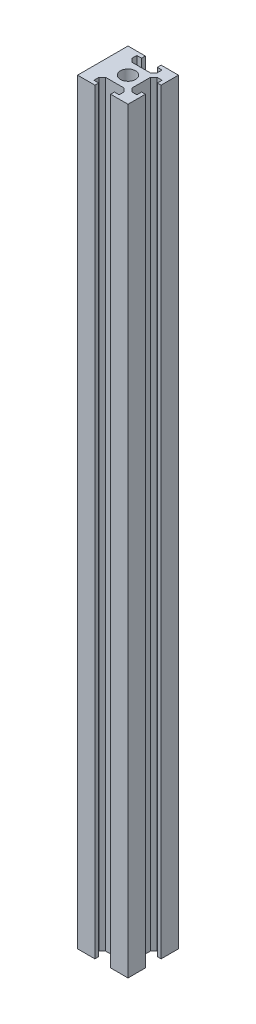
ISO-10303-21;
HEADER;
FILE_DESCRIPTION(('STEP AP214'),'2;1');
FILE_NAME('part.step','',(''),(''),'','','');
FILE_SCHEMA(('AUTOMOTIVE_DESIGN { 1 0 10303 214 1 1 1 1 }'));
ENDSEC;
DATA;
#1=APPLICATION_CONTEXT('core data for automotive mechanical design processes');
#2=APPLICATION_PROTOCOL_DEFINITION('international standard','automotive_design',2000,#1);
#3=PRODUCT_CONTEXT('',#1,'mechanical');
#4=PRODUCT('Part','Part','',(#3));
#5=PRODUCT_RELATED_PRODUCT_CATEGORY('part','',(#4));
#6=PRODUCT_DEFINITION_FORMATION('','',#4);
#7=PRODUCT_DEFINITION_CONTEXT('part definition',#1,'design');
#8=PRODUCT_DEFINITION('design','',#6,#7);
#9=PRODUCT_DEFINITION_SHAPE('','',#8);
#10=(LENGTH_UNIT() NAMED_UNIT(*) SI_UNIT(.MILLI.,.METRE.));
#11=(NAMED_UNIT(*) PLANE_ANGLE_UNIT() SI_UNIT($,.RADIAN.));
#12=(NAMED_UNIT(*) SI_UNIT($,.STERADIAN.) SOLID_ANGLE_UNIT());
#13=UNCERTAINTY_MEASURE_WITH_UNIT(LENGTH_MEASURE(1.E-05),#10,'distance_accuracy_value','');
#14=(GEOMETRIC_REPRESENTATION_CONTEXT(3) GLOBAL_UNCERTAINTY_ASSIGNED_CONTEXT((#13)) GLOBAL_UNIT_ASSIGNED_CONTEXT((#10,
#11,#12)) REPRESENTATION_CONTEXT('',''));
#15=CARTESIAN_POINT('',(0.,0.,0.));
#16=DIRECTION('',(0.,0.,1.));
#17=DIRECTION('',(1.,0.,0.));
#18=AXIS2_PLACEMENT_3D('',#15,#16,#17);
#19=CARTESIAN_POINT('',(0.,300.,0.));
#20=DIRECTION('',(0.,1.,0.));
#21=DIRECTION('',(0.,0.,1.));
#22=AXIS2_PLACEMENT_3D('',#19,#20,#21);
#23=PLANE('',#22);
#24=DIRECTION('',(0.,0.,1.));
#25=VECTOR('',#24,1.);
#26=CARTESIAN_POINT('',(-10.,300.,-10.));
#27=LINE('',#26,#25);
#28=CARTESIAN_POINT('',(-10.,300.,-10.));
#29=VERTEX_POINT('',#28);
#30=CARTESIAN_POINT('',(-10.,300.,10.));
#31=VERTEX_POINT('',#30);
#32=EDGE_CURVE('E353',#29,#31,#27,.T.);
#33=ORIENTED_EDGE('',*,*,#32,.T.);
#34=DIRECTION('',(1.,0.,0.));
#35=VECTOR('',#34,1.);
#36=CARTESIAN_POINT('',(-10.,300.,10.));
#37=LINE('',#36,#35);
#38=CARTESIAN_POINT('',(-3.125,300.,10.));
#39=VERTEX_POINT('',#38);
#40=EDGE_CURVE('E171',#31,#39,#37,.T.);
#41=ORIENTED_EDGE('',*,*,#40,.T.);
#42=DIRECTION('',(0.,0.,-1.));
#43=VECTOR('',#42,1.);
#44=CARTESIAN_POINT('',(-3.125,300.,10.));
#45=LINE('',#44,#43);
#46=CARTESIAN_POINT('',(-3.125,300.,8.5));
#47=VERTEX_POINT('',#46);
#48=EDGE_CURVE('E446',#39,#47,#45,.T.);
#49=ORIENTED_EDGE('',*,*,#48,.T.);
#50=DIRECTION('',(-1.,0.,0.));
#51=VECTOR('',#50,1.);
#52=CARTESIAN_POINT('',(-3.125,300.,8.5));
#53=LINE('',#52,#51);
#54=CARTESIAN_POINT('',(-5.,300.,8.5));
#55=VERTEX_POINT('',#54);
#56=EDGE_CURVE('E465',#47,#55,#53,.T.);
#57=ORIENTED_EDGE('',*,*,#56,.T.);
#58=DIRECTION('',(0.,0.,-1.));
#59=VECTOR('',#58,1.);
#60=CARTESIAN_POINT('',(-5.,300.,8.5));
#61=LINE('',#60,#59);
#62=CARTESIAN_POINT('',(-5.00000000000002,300.,6.50482755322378));
#63=VERTEX_POINT('',#62);
#64=EDGE_CURVE('E462',#55,#63,#61,.T.);
#65=ORIENTED_EDGE('',*,*,#64,.T.);
#66=DIRECTION('',(0.703833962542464,0.,-0.71036452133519));
#67=VECTOR('',#66,1.);
#68=CARTESIAN_POINT('',(-5.00000000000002,300.,6.50482755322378));
#69=LINE('',#68,#67);
#70=CARTESIAN_POINT('',(-3.7071680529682,300.,5.19999999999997));
#71=VERTEX_POINT('',#70);
#72=EDGE_CURVE('E464',#63,#71,#69,.T.);
#73=ORIENTED_EDGE('',*,*,#72,.T.);
#74=DIRECTION('',(1.,0.,0.));
#75=VECTOR('',#74,1.);
#76=CARTESIAN_POINT('',(3.7071680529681,300.,5.20000000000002));
#77=LINE('',#76,#75);
#78=CARTESIAN_POINT('',(3.7071680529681,300.,5.20000000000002));
#79=VERTEX_POINT('',#78);
#80=EDGE_CURVE('E467',#71,#79,#77,.T.);
#81=ORIENTED_EDGE('',*,*,#80,.T.);
#82=DIRECTION('',(0.703833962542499,0.,0.710364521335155));
#83=VECTOR('',#82,1.);
#84=CARTESIAN_POINT('',(5.,300.,6.50482755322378));
#85=LINE('',#84,#83);
#86=CARTESIAN_POINT('',(5.,300.,6.50482755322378));
#87=VERTEX_POINT('',#86);
#88=EDGE_CURVE('E473',#79,#87,#85,.T.);
#89=ORIENTED_EDGE('',*,*,#88,.T.);
#90=DIRECTION('',(0.,0.,1.));
#91=VECTOR('',#90,1.);
#92=CARTESIAN_POINT('',(5.,300.,8.5));
#93=LINE('',#92,#91);
#94=CARTESIAN_POINT('',(5.,300.,8.5));
#95=VERTEX_POINT('',#94);
#96=EDGE_CURVE('E475',#87,#95,#93,.T.);
#97=ORIENTED_EDGE('',*,*,#96,.T.);
#98=DIRECTION('',(-1.,0.,0.));
#99=VECTOR('',#98,1.);
#100=CARTESIAN_POINT('',(3.125,300.,8.5));
#101=LINE('',#100,#99);
#102=CARTESIAN_POINT('',(3.125,300.,8.5));
#103=VERTEX_POINT('',#102);
#104=EDGE_CURVE('E477',#95,#103,#101,.T.);
#105=ORIENTED_EDGE('',*,*,#104,.T.);
#106=DIRECTION('',(0.,0.,1.));
#107=VECTOR('',#106,1.);
#108=CARTESIAN_POINT('',(3.125,300.,10.));
#109=LINE('',#108,#107);
#110=CARTESIAN_POINT('',(3.125,300.,10.));
#111=VERTEX_POINT('',#110);
#112=EDGE_CURVE('E479',#103,#111,#109,.T.);
#113=ORIENTED_EDGE('',*,*,#112,.T.);
#114=DIRECTION('',(1.,0.,0.));
#115=VECTOR('',#114,1.);
#116=CARTESIAN_POINT('',(3.125,300.,10.));
#117=LINE('',#116,#115);
#118=CARTESIAN_POINT('',(10.,300.,10.));
#119=VERTEX_POINT('',#118);
#120=EDGE_CURVE('E481',#111,#119,#117,.T.);
#121=ORIENTED_EDGE('',*,*,#120,.T.);
#122=DIRECTION('',(0.,0.,-1.));
#123=VECTOR('',#122,1.);
#124=CARTESIAN_POINT('',(9.99999999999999,300.,3.12500000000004));
#125=LINE('',#124,#123);
#126=CARTESIAN_POINT('',(9.99999999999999,300.,3.12500000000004));
#127=VERTEX_POINT('',#126);
#128=EDGE_CURVE('E483',#119,#127,#125,.T.);
#129=ORIENTED_EDGE('',*,*,#128,.T.);
#130=DIRECTION('',(-1.,0.,0.));
#131=VECTOR('',#130,1.);
#132=CARTESIAN_POINT('',(9.99999999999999,300.,3.12500000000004));
#133=LINE('',#132,#131);
#134=CARTESIAN_POINT('',(8.49999999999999,300.,3.12500000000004));
#135=VERTEX_POINT('',#134);
#136=EDGE_CURVE('E485',#127,#135,#133,.T.);
#137=ORIENTED_EDGE('',*,*,#136,.T.);
#138=DIRECTION('',(0.,0.,1.));
#139=VECTOR('',#138,1.);
#140=CARTESIAN_POINT('',(8.49999999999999,300.,3.12500000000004));
#141=LINE('',#140,#139);
#142=CARTESIAN_POINT('',(8.49999999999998,300.,5.00000000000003));
#143=VERTEX_POINT('',#142);
#144=EDGE_CURVE('E487',#135,#143,#141,.T.);
#145=ORIENTED_EDGE('',*,*,#144,.T.);
#146=DIRECTION('',(-1.,0.,0.));
#147=VECTOR('',#146,1.);
#148=CARTESIAN_POINT('',(8.49999999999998,300.,5.00000000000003));
#149=LINE('',#148,#147);
#150=CARTESIAN_POINT('',(6.50482755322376,300.,5.00000000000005));
#151=VERTEX_POINT('',#150);
#152=EDGE_CURVE('E489',#143,#151,#149,.T.);
#153=ORIENTED_EDGE('',*,*,#152,.T.);
#154=DIRECTION('',(-0.71036452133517,0.,-0.703833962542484));
#155=VECTOR('',#154,1.);
#156=CARTESIAN_POINT('',(6.50482755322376,300.,5.00000000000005));
#157=LINE('',#156,#155);
#158=CARTESIAN_POINT('',(5.19999999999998,300.,3.70716805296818));
#159=VERTEX_POINT('',#158);
#160=EDGE_CURVE('E491',#151,#159,#157,.T.);
#161=ORIENTED_EDGE('',*,*,#160,.T.);
#162=DIRECTION('',(0.,0.,-1.));
#163=VECTOR('',#162,1.);
#164=CARTESIAN_POINT('',(5.20000000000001,300.,-3.70716805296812));
#165=LINE('',#164,#163);
#166=CARTESIAN_POINT('',(5.20000000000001,300.,-3.70716805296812));
#167=VERTEX_POINT('',#166);
#168=EDGE_CURVE('E493',#159,#167,#165,.T.);
#169=ORIENTED_EDGE('',*,*,#168,.T.);
#170=DIRECTION('',(0.710364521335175,0.,-0.703833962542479));
#171=VECTOR('',#170,1.);
#172=CARTESIAN_POINT('',(6.5048275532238,300.,-4.99999999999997));
#173=LINE('',#172,#171);
#174=CARTESIAN_POINT('',(6.5048275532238,300.,-4.99999999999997));
#175=VERTEX_POINT('',#174);
#176=EDGE_CURVE('E495',#167,#175,#173,.T.);
#177=ORIENTED_EDGE('',*,*,#176,.T.);
#178=DIRECTION('',(1.,0.,0.));
#179=VECTOR('',#178,1.);
#180=CARTESIAN_POINT('',(8.50000000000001,300.,-4.99999999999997));
#181=LINE('',#180,#179);
#182=CARTESIAN_POINT('',(8.50000000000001,300.,-4.99999999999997));
#183=VERTEX_POINT('',#182);
#184=EDGE_CURVE('E497',#175,#183,#181,.T.);
#185=ORIENTED_EDGE('',*,*,#184,.T.);
#186=DIRECTION('',(0.,0.,1.));
#187=VECTOR('',#186,1.);
#188=CARTESIAN_POINT('',(8.50000000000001,300.,-3.12499999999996));
#189=LINE('',#188,#187);
#190=CARTESIAN_POINT('',(8.50000000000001,300.,-3.12499999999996));
#191=VERTEX_POINT('',#190);
#192=EDGE_CURVE('E499',#183,#191,#189,.T.);
#193=ORIENTED_EDGE('',*,*,#192,.T.);
#194=DIRECTION('',(1.,0.,0.));
#195=VECTOR('',#194,1.);
#196=CARTESIAN_POINT('',(10.,300.,-3.12499999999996));
#197=LINE('',#196,#195);
#198=CARTESIAN_POINT('',(10.,300.,-3.12499999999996));
#199=VERTEX_POINT('',#198);
#200=EDGE_CURVE('E501',#191,#199,#197,.T.);
#201=ORIENTED_EDGE('',*,*,#200,.T.);
#202=DIRECTION('',(0.,0.,-1.));
#203=VECTOR('',#202,1.);
#204=CARTESIAN_POINT('',(10.,300.,-10.));
#205=LINE('',#204,#203);
#206=CARTESIAN_POINT('',(10.,300.,-10.));
#207=VERTEX_POINT('',#206);
#208=EDGE_CURVE('E503',#199,#207,#205,.T.);
#209=ORIENTED_EDGE('',*,*,#208,.T.);
#210=DIRECTION('',(-1.,0.,0.));
#211=VECTOR('',#210,1.);
#212=CARTESIAN_POINT('',(3.125,300.,-10.));
#213=LINE('',#212,#211);
#214=CARTESIAN_POINT('',(3.125,300.,-10.));
#215=VERTEX_POINT('',#214);
#216=EDGE_CURVE('E505',#207,#215,#213,.T.);
#217=ORIENTED_EDGE('',*,*,#216,.T.);
#218=DIRECTION('',(0.,0.,1.));
#219=VECTOR('',#218,1.);
#220=CARTESIAN_POINT('',(3.125,300.,-10.));
#221=LINE('',#220,#219);
#222=CARTESIAN_POINT('',(3.12500000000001,300.,-8.5));
#223=VERTEX_POINT('',#222);
#224=EDGE_CURVE('E507',#215,#223,#221,.T.);
#225=ORIENTED_EDGE('',*,*,#224,.T.);
#226=DIRECTION('',(1.,0.,0.));
#227=VECTOR('',#226,1.);
#228=CARTESIAN_POINT('',(3.12500000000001,300.,-8.5));
#229=LINE('',#228,#227);
#230=CARTESIAN_POINT('',(5.00000000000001,300.,-8.5));
#231=VERTEX_POINT('',#230);
#232=EDGE_CURVE('E509',#223,#231,#229,.T.);
#233=ORIENTED_EDGE('',*,*,#232,.T.);
#234=DIRECTION('',(0.,0.,1.));
#235=VECTOR('',#234,1.);
#236=CARTESIAN_POINT('',(5.00000000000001,300.,-8.5));
#237=LINE('',#236,#235);
#238=CARTESIAN_POINT('',(5.00000000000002,300.,-6.50482755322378));
#239=VERTEX_POINT('',#238);
#240=EDGE_CURVE('E511',#231,#239,#237,.T.);
#241=ORIENTED_EDGE('',*,*,#240,.T.);
#242=DIRECTION('',(-0.703833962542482,0.,0.710364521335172));
#243=VECTOR('',#242,1.);
#244=CARTESIAN_POINT('',(5.00000000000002,300.,-6.50482755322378));
#245=LINE('',#244,#243);
#246=CARTESIAN_POINT('',(3.70716805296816,300.,-5.2));
#247=VERTEX_POINT('',#246);
#248=EDGE_CURVE('E513',#239,#247,#245,.T.);
#249=ORIENTED_EDGE('',*,*,#248,.T.);
#250=DIRECTION('',(-1.,0.,0.));
#251=VECTOR('',#250,1.);
#252=CARTESIAN_POINT('',(-3.70716805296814,300.,-5.2));
#253=LINE('',#252,#251);
#254=CARTESIAN_POINT('',(-3.70716805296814,300.,-5.2));
#255=VERTEX_POINT('',#254);
#256=EDGE_CURVE('E515',#247,#255,#253,.T.);
#257=ORIENTED_EDGE('',*,*,#256,.T.);
#258=DIRECTION('',(-0.703833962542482,0.,-0.710364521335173));
#259=VECTOR('',#258,1.);
#260=CARTESIAN_POINT('',(-4.99999999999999,300.,-6.50482755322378));
#261=LINE('',#260,#259);
#262=CARTESIAN_POINT('',(-4.99999999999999,300.,-6.50482755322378));
#263=VERTEX_POINT('',#262);
#264=EDGE_CURVE('E517',#255,#263,#261,.T.);
#265=ORIENTED_EDGE('',*,*,#264,.T.);
#266=DIRECTION('',(0.,0.,-1.));
#267=VECTOR('',#266,1.);
#268=CARTESIAN_POINT('',(-4.99999999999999,300.,-8.5));
#269=LINE('',#268,#267);
#270=CARTESIAN_POINT('',(-4.99999999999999,300.,-8.5));
#271=VERTEX_POINT('',#270);
#272=EDGE_CURVE('E268',#263,#271,#269,.T.);
#273=ORIENTED_EDGE('',*,*,#272,.T.);
#274=DIRECTION('',(1.,0.,0.));
#275=VECTOR('',#274,1.);
#276=CARTESIAN_POINT('',(-3.12499999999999,300.,-8.5));
#277=LINE('',#276,#275);
#278=CARTESIAN_POINT('',(-3.12499999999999,300.,-8.5));
#279=VERTEX_POINT('',#278);
#280=EDGE_CURVE('E262',#271,#279,#277,.T.);
#281=ORIENTED_EDGE('',*,*,#280,.T.);
#282=DIRECTION('',(0.,0.,-1.));
#283=VECTOR('',#282,1.);
#284=CARTESIAN_POINT('',(-3.12499999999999,300.,-10.));
#285=LINE('',#284,#283);
#286=CARTESIAN_POINT('',(-3.12499999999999,300.,-10.));
#287=VERTEX_POINT('',#286);
#288=EDGE_CURVE('E266',#279,#287,#285,.T.);
#289=ORIENTED_EDGE('',*,*,#288,.T.);
#290=DIRECTION('',(-1.,0.,0.));
#291=VECTOR('',#290,1.);
#292=CARTESIAN_POINT('',(-10.,300.,-10.));
#293=LINE('',#292,#291);
#294=EDGE_CURVE('E50',#287,#29,#293,.T.);
#295=ORIENTED_EDGE('',*,*,#294,.T.);
#296=EDGE_LOOP('',(#33,#41,#49,#57,#65,#73,#81,#89,#97,#105,#113,#121,#129,#137,#145,#153,#161,
#169,#177,#185,#193,#201,#209,#217,#225,#233,#241,#249,#257,#265,#273,#281,#289,#295));
#297=FACE_BOUND('',#296,.T.);
#298=CARTESIAN_POINT('',(0.,300.,0.));
#299=DIRECTION('',(0.,1.,0.));
#300=DIRECTION('',(0.,0.,1.));
#301=AXIS2_PLACEMENT_3D('',#298,#299,#300);
#302=CIRCLE('',#301,3.);
#303=CARTESIAN_POINT('',(0.,300.,2.99999999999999));
#304=VERTEX_POINT('',#303);
#305=EDGE_CURVE('E290',#304,#304,#302,.T.);
#306=ORIENTED_EDGE('',*,*,#305,.F.);
#307=EDGE_LOOP('',(#306));
#308=FACE_BOUND('',#307,.T.);
#309=ADVANCED_FACE('F33',(#297,#308),#23,.T.);
#310=CARTESIAN_POINT('',(0.,0.,0.));
#311=DIRECTION('',(0.,1.,0.));
#312=DIRECTION('',(0.,0.,1.));
#313=AXIS2_PLACEMENT_3D('',#310,#311,#312);
#314=PLANE('',#313);
#315=DIRECTION('',(0.,0.,1.));
#316=VECTOR('',#315,1.);
#317=CARTESIAN_POINT('',(-10.,0.,-10.));
#318=LINE('',#317,#316);
#319=CARTESIAN_POINT('',(-10.,0.,-10.));
#320=VERTEX_POINT('',#319);
#321=CARTESIAN_POINT('',(-10.,0.,10.));
#322=VERTEX_POINT('',#321);
#323=EDGE_CURVE('E286',#320,#322,#318,.T.);
#324=ORIENTED_EDGE('',*,*,#323,.F.);
#325=DIRECTION('',(-1.,0.,0.));
#326=VECTOR('',#325,1.);
#327=CARTESIAN_POINT('',(-10.,0.,-10.));
#328=LINE('',#327,#326);
#329=CARTESIAN_POINT('',(-3.12499999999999,0.,-10.));
#330=VERTEX_POINT('',#329);
#331=EDGE_CURVE('E163',#330,#320,#328,.T.);
#332=ORIENTED_EDGE('',*,*,#331,.F.);
#333=DIRECTION('',(0.,0.,-1.));
#334=VECTOR('',#333,1.);
#335=CARTESIAN_POINT('',(-3.12499999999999,0.,-10.));
#336=LINE('',#335,#334);
#337=CARTESIAN_POINT('',(-3.12499999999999,0.,-8.5));
#338=VERTEX_POINT('',#337);
#339=EDGE_CURVE('E157',#338,#330,#336,.T.);
#340=ORIENTED_EDGE('',*,*,#339,.F.);
#341=DIRECTION('',(1.,0.,0.));
#342=VECTOR('',#341,1.);
#343=CARTESIAN_POINT('',(-3.12499999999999,0.,-8.5));
#344=LINE('',#343,#342);
#345=CARTESIAN_POINT('',(-4.99999999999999,0.,-8.5));
#346=VERTEX_POINT('',#345);
#347=EDGE_CURVE('E276',#346,#338,#344,.T.);
#348=ORIENTED_EDGE('',*,*,#347,.F.);
#349=DIRECTION('',(0.,0.,-1.));
#350=VECTOR('',#349,1.);
#351=CARTESIAN_POINT('',(-4.99999999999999,0.,-8.5));
#352=LINE('',#351,#350);
#353=CARTESIAN_POINT('',(-4.99999999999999,0.,-6.50482755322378));
#354=VERTEX_POINT('',#353);
#355=EDGE_CURVE('E348',#354,#346,#352,.T.);
#356=ORIENTED_EDGE('',*,*,#355,.F.);
#357=DIRECTION('',(-0.703833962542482,0.,-0.710364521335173));
#358=VECTOR('',#357,1.);
#359=CARTESIAN_POINT('',(-4.99999999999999,0.,-6.50482755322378));
#360=LINE('',#359,#358);
#361=CARTESIAN_POINT('',(-3.70716805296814,0.,-5.2));
#362=VERTEX_POINT('',#361);
#363=EDGE_CURVE('E346',#362,#354,#360,.T.);
#364=ORIENTED_EDGE('',*,*,#363,.F.);
#365=DIRECTION('',(-1.,0.,0.));
#366=VECTOR('',#365,1.);
#367=CARTESIAN_POINT('',(-3.70716805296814,0.,-5.2));
#368=LINE('',#367,#366);
#369=CARTESIAN_POINT('',(3.70716805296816,0.,-5.2));
#370=VERTEX_POINT('',#369);
#371=EDGE_CURVE('E344',#370,#362,#368,.T.);
#372=ORIENTED_EDGE('',*,*,#371,.F.);
#373=DIRECTION('',(-0.703833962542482,0.,0.710364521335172));
#374=VECTOR('',#373,1.);
#375=CARTESIAN_POINT('',(5.00000000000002,0.,-6.50482755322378));
#376=LINE('',#375,#374);
#377=CARTESIAN_POINT('',(5.00000000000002,0.,-6.50482755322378));
#378=VERTEX_POINT('',#377);
#379=EDGE_CURVE('E342',#378,#370,#376,.T.);
#380=ORIENTED_EDGE('',*,*,#379,.F.);
#381=DIRECTION('',(0.,0.,1.));
#382=VECTOR('',#381,1.);
#383=CARTESIAN_POINT('',(5.00000000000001,0.,-8.5));
#384=LINE('',#383,#382);
#385=CARTESIAN_POINT('',(5.00000000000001,0.,-8.5));
#386=VERTEX_POINT('',#385);
#387=EDGE_CURVE('E340',#386,#378,#384,.T.);
#388=ORIENTED_EDGE('',*,*,#387,.F.);
#389=DIRECTION('',(1.,0.,0.));
#390=VECTOR('',#389,1.);
#391=CARTESIAN_POINT('',(3.12500000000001,0.,-8.5));
#392=LINE('',#391,#390);
#393=CARTESIAN_POINT('',(3.12500000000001,0.,-8.5));
#394=VERTEX_POINT('',#393);
#395=EDGE_CURVE('E338',#394,#386,#392,.T.);
#396=ORIENTED_EDGE('',*,*,#395,.F.);
#397=DIRECTION('',(0.,0.,1.));
#398=VECTOR('',#397,1.);
#399=CARTESIAN_POINT('',(3.125,0.,-10.));
#400=LINE('',#399,#398);
#401=CARTESIAN_POINT('',(3.125,0.,-10.));
#402=VERTEX_POINT('',#401);
#403=EDGE_CURVE('E336',#402,#394,#400,.T.);
#404=ORIENTED_EDGE('',*,*,#403,.F.);
#405=DIRECTION('',(-1.,0.,0.));
#406=VECTOR('',#405,1.);
#407=CARTESIAN_POINT('',(3.125,0.,-10.));
#408=LINE('',#407,#406);
#409=CARTESIAN_POINT('',(10.,0.,-10.));
#410=VERTEX_POINT('',#409);
#411=EDGE_CURVE('E334',#410,#402,#408,.T.);
#412=ORIENTED_EDGE('',*,*,#411,.F.);
#413=DIRECTION('',(0.,0.,-1.));
#414=VECTOR('',#413,1.);
#415=CARTESIAN_POINT('',(10.,0.,-10.));
#416=LINE('',#415,#414);
#417=CARTESIAN_POINT('',(10.,0.,-3.12499999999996));
#418=VERTEX_POINT('',#417);
#419=EDGE_CURVE('E332',#418,#410,#416,.T.);
#420=ORIENTED_EDGE('',*,*,#419,.F.);
#421=DIRECTION('',(1.,0.,0.));
#422=VECTOR('',#421,1.);
#423=CARTESIAN_POINT('',(10.,0.,-3.12499999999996));
#424=LINE('',#423,#422);
#425=CARTESIAN_POINT('',(8.50000000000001,0.,-3.12499999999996));
#426=VERTEX_POINT('',#425);
#427=EDGE_CURVE('E330',#426,#418,#424,.T.);
#428=ORIENTED_EDGE('',*,*,#427,.F.);
#429=DIRECTION('',(0.,0.,1.));
#430=VECTOR('',#429,1.);
#431=CARTESIAN_POINT('',(8.50000000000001,0.,-3.12499999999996));
#432=LINE('',#431,#430);
#433=CARTESIAN_POINT('',(8.50000000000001,0.,-4.99999999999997));
#434=VERTEX_POINT('',#433);
#435=EDGE_CURVE('E328',#434,#426,#432,.T.);
#436=ORIENTED_EDGE('',*,*,#435,.F.);
#437=DIRECTION('',(1.,0.,0.));
#438=VECTOR('',#437,1.);
#439=CARTESIAN_POINT('',(8.50000000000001,0.,-4.99999999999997));
#440=LINE('',#439,#438);
#441=CARTESIAN_POINT('',(6.5048275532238,0.,-4.99999999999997));
#442=VERTEX_POINT('',#441);
#443=EDGE_CURVE('E326',#442,#434,#440,.T.);
#444=ORIENTED_EDGE('',*,*,#443,.F.);
#445=DIRECTION('',(0.710364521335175,0.,-0.703833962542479));
#446=VECTOR('',#445,1.);
#447=CARTESIAN_POINT('',(6.5048275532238,0.,-4.99999999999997));
#448=LINE('',#447,#446);
#449=CARTESIAN_POINT('',(5.20000000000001,0.,-3.70716805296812));
#450=VERTEX_POINT('',#449);
#451=EDGE_CURVE('E324',#450,#442,#448,.T.);
#452=ORIENTED_EDGE('',*,*,#451,.F.);
#453=DIRECTION('',(0.,0.,-1.));
#454=VECTOR('',#453,1.);
#455=CARTESIAN_POINT('',(5.20000000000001,0.,-3.70716805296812));
#456=LINE('',#455,#454);
#457=CARTESIAN_POINT('',(5.19999999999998,0.,3.70716805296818));
#458=VERTEX_POINT('',#457);
#459=EDGE_CURVE('E322',#458,#450,#456,.T.);
#460=ORIENTED_EDGE('',*,*,#459,.F.);
#461=DIRECTION('',(-0.71036452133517,0.,-0.703833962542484));
#462=VECTOR('',#461,1.);
#463=CARTESIAN_POINT('',(6.50482755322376,0.,5.00000000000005));
#464=LINE('',#463,#462);
#465=CARTESIAN_POINT('',(6.50482755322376,0.,5.00000000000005));
#466=VERTEX_POINT('',#465);
#467=EDGE_CURVE('E320',#466,#458,#464,.T.);
#468=ORIENTED_EDGE('',*,*,#467,.F.);
#469=DIRECTION('',(-1.,0.,0.));
#470=VECTOR('',#469,1.);
#471=CARTESIAN_POINT('',(8.49999999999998,0.,5.00000000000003));
#472=LINE('',#471,#470);
#473=CARTESIAN_POINT('',(8.49999999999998,0.,5.00000000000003));
#474=VERTEX_POINT('',#473);
#475=EDGE_CURVE('E318',#474,#466,#472,.T.);
#476=ORIENTED_EDGE('',*,*,#475,.F.);
#477=DIRECTION('',(0.,0.,1.));
#478=VECTOR('',#477,1.);
#479=CARTESIAN_POINT('',(8.49999999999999,0.,3.12500000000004));
#480=LINE('',#479,#478);
#481=CARTESIAN_POINT('',(8.49999999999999,0.,3.12500000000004));
#482=VERTEX_POINT('',#481);
#483=EDGE_CURVE('E316',#482,#474,#480,.T.);
#484=ORIENTED_EDGE('',*,*,#483,.F.);
#485=DIRECTION('',(-1.,0.,0.));
#486=VECTOR('',#485,1.);
#487=CARTESIAN_POINT('',(9.99999999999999,0.,3.12500000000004));
#488=LINE('',#487,#486);
#489=CARTESIAN_POINT('',(9.99999999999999,0.,3.12500000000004));
#490=VERTEX_POINT('',#489);
#491=EDGE_CURVE('E314',#490,#482,#488,.T.);
#492=ORIENTED_EDGE('',*,*,#491,.F.);
#493=DIRECTION('',(0.,0.,-1.));
#494=VECTOR('',#493,1.);
#495=CARTESIAN_POINT('',(9.99999999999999,0.,3.12500000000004));
#496=LINE('',#495,#494);
#497=CARTESIAN_POINT('',(10.,0.,10.));
#498=VERTEX_POINT('',#497);
#499=EDGE_CURVE('E312',#498,#490,#496,.T.);
#500=ORIENTED_EDGE('',*,*,#499,.F.);
#501=DIRECTION('',(1.,0.,0.));
#502=VECTOR('',#501,1.);
#503=CARTESIAN_POINT('',(3.125,0.,10.));
#504=LINE('',#503,#502);
#505=CARTESIAN_POINT('',(3.125,0.,10.));
#506=VERTEX_POINT('',#505);
#507=EDGE_CURVE('E310',#506,#498,#504,.T.);
#508=ORIENTED_EDGE('',*,*,#507,.F.);
#509=DIRECTION('',(0.,0.,1.));
#510=VECTOR('',#509,1.);
#511=CARTESIAN_POINT('',(3.125,0.,10.));
#512=LINE('',#511,#510);
#513=CARTESIAN_POINT('',(3.125,0.,8.5));
#514=VERTEX_POINT('',#513);
#515=EDGE_CURVE('E308',#514,#506,#512,.T.);
#516=ORIENTED_EDGE('',*,*,#515,.F.);
#517=DIRECTION('',(-1.,0.,0.));
#518=VECTOR('',#517,1.);
#519=CARTESIAN_POINT('',(3.125,0.,8.5));
#520=LINE('',#519,#518);
#521=CARTESIAN_POINT('',(5.,0.,8.5));
#522=VERTEX_POINT('',#521);
#523=EDGE_CURVE('E306',#522,#514,#520,.T.);
#524=ORIENTED_EDGE('',*,*,#523,.F.);
#525=DIRECTION('',(0.,0.,1.));
#526=VECTOR('',#525,1.);
#527=CARTESIAN_POINT('',(5.,0.,8.5));
#528=LINE('',#527,#526);
#529=CARTESIAN_POINT('',(5.,0.,6.50482755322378));
#530=VERTEX_POINT('',#529);
#531=EDGE_CURVE('E304',#530,#522,#528,.T.);
#532=ORIENTED_EDGE('',*,*,#531,.F.);
#533=DIRECTION('',(0.703833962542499,0.,0.710364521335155));
#534=VECTOR('',#533,1.);
#535=CARTESIAN_POINT('',(5.,0.,6.50482755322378));
#536=LINE('',#535,#534);
#537=CARTESIAN_POINT('',(3.7071680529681,0.,5.20000000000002));
#538=VERTEX_POINT('',#537);
#539=EDGE_CURVE('E302',#538,#530,#536,.T.);
#540=ORIENTED_EDGE('',*,*,#539,.F.);
#541=DIRECTION('',(1.,0.,0.));
#542=VECTOR('',#541,1.);
#543=CARTESIAN_POINT('',(3.7071680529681,0.,5.20000000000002));
#544=LINE('',#543,#542);
#545=CARTESIAN_POINT('',(-3.7071680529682,0.,5.19999999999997));
#546=VERTEX_POINT('',#545);
#547=EDGE_CURVE('E300',#546,#538,#544,.T.);
#548=ORIENTED_EDGE('',*,*,#547,.F.);
#549=DIRECTION('',(0.703833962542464,0.,-0.71036452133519));
#550=VECTOR('',#549,1.);
#551=CARTESIAN_POINT('',(-5.00000000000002,0.,6.50482755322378));
#552=LINE('',#551,#550);
#553=CARTESIAN_POINT('',(-5.00000000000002,0.,6.50482755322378));
#554=VERTEX_POINT('',#553);
#555=EDGE_CURVE('E298',#554,#546,#552,.T.);
#556=ORIENTED_EDGE('',*,*,#555,.F.);
#557=DIRECTION('',(0.,0.,-1.));
#558=VECTOR('',#557,1.);
#559=CARTESIAN_POINT('',(-5.,0.,8.5));
#560=LINE('',#559,#558);
#561=CARTESIAN_POINT('',(-5.,0.,8.5));
#562=VERTEX_POINT('',#561);
#563=EDGE_CURVE('E296',#562,#554,#560,.T.);
#564=ORIENTED_EDGE('',*,*,#563,.F.);
#565=DIRECTION('',(-1.,0.,0.));
#566=VECTOR('',#565,1.);
#567=CARTESIAN_POINT('',(-3.125,0.,8.5));
#568=LINE('',#567,#566);
#569=CARTESIAN_POINT('',(-3.125,0.,8.5));
#570=VERTEX_POINT('',#569);
#571=EDGE_CURVE('E294',#570,#562,#568,.T.);
#572=ORIENTED_EDGE('',*,*,#571,.F.);
#573=DIRECTION('',(0.,0.,-1.));
#574=VECTOR('',#573,1.);
#575=CARTESIAN_POINT('',(-3.125,0.,10.));
#576=LINE('',#575,#574);
#577=CARTESIAN_POINT('',(-3.125,0.,10.));
#578=VERTEX_POINT('',#577);
#579=EDGE_CURVE('E292',#578,#570,#576,.T.);
#580=ORIENTED_EDGE('',*,*,#579,.F.);
#581=DIRECTION('',(1.,0.,0.));
#582=VECTOR('',#581,1.);
#583=CARTESIAN_POINT('',(-10.,0.,10.));
#584=LINE('',#583,#582);
#585=EDGE_CURVE('E289',#322,#578,#584,.T.);
#586=ORIENTED_EDGE('',*,*,#585,.F.);
#587=EDGE_LOOP('',(#324,#332,#340,#348,#356,#364,#372,#380,#388,#396,#404,#412,#420,#428,#436,
#444,#452,#460,#468,#476,#484,#492,#500,#508,#516,#524,#532,#540,#548,#556,#564,#572,#580,#586));
#588=FACE_BOUND('',#587,.T.);
#589=CARTESIAN_POINT('',(0.,0.,0.));
#590=DIRECTION('',(0.,1.,0.));
#591=DIRECTION('',(0.,0.,1.));
#592=AXIS2_PLACEMENT_3D('',#589,#590,#591);
#593=CIRCLE('',#592,3.);
#594=CARTESIAN_POINT('',(0.,0.,2.99999999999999));
#595=VERTEX_POINT('',#594);
#596=EDGE_CURVE('E950',#595,#595,#593,.T.);
#597=ORIENTED_EDGE('',*,*,#596,.T.);
#598=EDGE_LOOP('',(#597));
#599=FACE_BOUND('',#598,.T.);
#600=ADVANCED_FACE('F450',(#588,#599),#314,.F.);
#601=CARTESIAN_POINT('',(-10.,300.,-10.));
#602=DIRECTION('',(1.,0.,0.));
#603=DIRECTION('',(0.,0.,-1.));
#604=AXIS2_PLACEMENT_3D('',#601,#602,#603);
#605=PLANE('',#604);
#606=ORIENTED_EDGE('',*,*,#323,.T.);
#607=DIRECTION('',(0.,-1.,0.));
#608=VECTOR('',#607,1.);
#609=CARTESIAN_POINT('',(-10.,300.,10.));
#610=LINE('',#609,#608);
#611=EDGE_CURVE('E11',#31,#322,#610,.T.);
#612=ORIENTED_EDGE('',*,*,#611,.F.);
#613=ORIENTED_EDGE('',*,*,#32,.F.);
#614=DIRECTION('',(0.,-1.,0.));
#615=VECTOR('',#614,1.);
#616=CARTESIAN_POINT('',(-10.,300.,-10.));
#617=LINE('',#616,#615);
#618=EDGE_CURVE('E282',#29,#320,#617,.T.);
#619=ORIENTED_EDGE('',*,*,#618,.T.);
#620=EDGE_LOOP('',(#606,#612,#613,#619));
#621=FACE_BOUND('',#620,.T.);
#622=ADVANCED_FACE('F35',(#621),#605,.F.);
#623=CARTESIAN_POINT('',(-10.,300.,10.));
#624=DIRECTION('',(0.,0.,-1.));
#625=DIRECTION('',(-1.,0.,0.));
#626=AXIS2_PLACEMENT_3D('',#623,#624,#625);
#627=PLANE('',#626);
#628=ORIENTED_EDGE('',*,*,#585,.T.);
#629=DIRECTION('',(0.,-1.,0.));
#630=VECTOR('',#629,1.);
#631=CARTESIAN_POINT('',(-3.125,300.,10.));
#632=LINE('',#631,#630);
#633=EDGE_CURVE('E42',#39,#578,#632,.T.);
#634=ORIENTED_EDGE('',*,*,#633,.F.);
#635=ORIENTED_EDGE('',*,*,#40,.F.);
#636=ORIENTED_EDGE('',*,*,#611,.T.);
#637=EDGE_LOOP('',(#628,#634,#635,#636));
#638=FACE_BOUND('',#637,.T.);
#639=ADVANCED_FACE('F551',(#638),#627,.F.);
#640=CARTESIAN_POINT('',(-3.125,300.,10.));
#641=DIRECTION('',(-1.,0.,0.));
#642=DIRECTION('',(0.,0.,1.));
#643=AXIS2_PLACEMENT_3D('',#640,#641,#642);
#644=PLANE('',#643);
#645=ORIENTED_EDGE('',*,*,#579,.T.);
#646=DIRECTION('',(0.,-1.,0.));
#647=VECTOR('',#646,1.);
#648=CARTESIAN_POINT('',(-3.125,300.,8.5));
#649=LINE('',#648,#647);
#650=EDGE_CURVE('E438',#47,#570,#649,.T.);
#651=ORIENTED_EDGE('',*,*,#650,.F.);
#652=ORIENTED_EDGE('',*,*,#48,.F.);
#653=ORIENTED_EDGE('',*,*,#633,.T.);
#654=EDGE_LOOP('',(#645,#651,#652,#653));
#655=FACE_BOUND('',#654,.T.);
#656=ADVANCED_FACE('F444',(#655),#644,.F.);
#657=CARTESIAN_POINT('',(-3.125,300.,8.5));
#658=DIRECTION('',(0.,0.,1.));
#659=DIRECTION('',(1.,0.,0.));
#660=AXIS2_PLACEMENT_3D('',#657,#658,#659);
#661=PLANE('',#660);
#662=ORIENTED_EDGE('',*,*,#571,.T.);
#663=DIRECTION('',(0.,-1.,0.));
#664=VECTOR('',#663,1.);
#665=CARTESIAN_POINT('',(-5.,300.,8.5));
#666=LINE('',#665,#664);
#667=EDGE_CURVE('E435',#55,#562,#666,.T.);
#668=ORIENTED_EDGE('',*,*,#667,.F.);
#669=ORIENTED_EDGE('',*,*,#56,.F.);
#670=ORIENTED_EDGE('',*,*,#650,.T.);
#671=EDGE_LOOP('',(#662,#668,#669,#670));
#672=FACE_BOUND('',#671,.T.);
#673=ADVANCED_FACE('F456',(#672),#661,.F.);
#674=CARTESIAN_POINT('',(-5.,300.,8.5));
#675=DIRECTION('',(-1.,0.,0.));
#676=DIRECTION('',(0.,0.,1.));
#677=AXIS2_PLACEMENT_3D('',#674,#675,#676);
#678=PLANE('',#677);
#679=ORIENTED_EDGE('',*,*,#563,.T.);
#680=DIRECTION('',(0.,-1.,0.));
#681=VECTOR('',#680,1.);
#682=CARTESIAN_POINT('',(-5.00000000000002,300.,6.50482755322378));
#683=LINE('',#682,#681);
#684=EDGE_CURVE('E432',#63,#554,#683,.T.);
#685=ORIENTED_EDGE('',*,*,#684,.F.);
#686=ORIENTED_EDGE('',*,*,#64,.F.);
#687=ORIENTED_EDGE('',*,*,#667,.T.);
#688=EDGE_LOOP('',(#679,#685,#686,#687));
#689=FACE_BOUND('',#688,.T.);
#690=ADVANCED_FACE('F460',(#689),#678,.F.);
#691=CARTESIAN_POINT('',(-5.00000000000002,300.,6.50482755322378));
#692=DIRECTION('',(-0.71036452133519,0.,-0.703833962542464));
#693=DIRECTION('',(-0.703833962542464,0.,0.71036452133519));
#694=AXIS2_PLACEMENT_3D('',#691,#692,#693);
#695=PLANE('',#694);
#696=ORIENTED_EDGE('',*,*,#555,.T.);
#697=DIRECTION('',(0.,-1.,0.));
#698=VECTOR('',#697,1.);
#699=CARTESIAN_POINT('',(-3.7071680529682,300.,5.19999999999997));
#700=LINE('',#699,#698);
#701=EDGE_CURVE('E429',#71,#546,#700,.T.);
#702=ORIENTED_EDGE('',*,*,#701,.F.);
#703=ORIENTED_EDGE('',*,*,#72,.F.);
#704=ORIENTED_EDGE('',*,*,#684,.T.);
#705=EDGE_LOOP('',(#696,#702,#703,#704));
#706=FACE_BOUND('',#705,.T.);
#707=ADVANCED_FACE('F564',(#706),#695,.F.);
#708=CARTESIAN_POINT('',(3.7071680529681,300.,5.20000000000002));
#709=DIRECTION('',(0.,0.,-1.));
#710=DIRECTION('',(-1.,0.,0.));
#711=AXIS2_PLACEMENT_3D('',#708,#709,#710);
#712=PLANE('',#711);
#713=ORIENTED_EDGE('',*,*,#547,.T.);
#714=DIRECTION('',(0.,-1.,0.));
#715=VECTOR('',#714,1.);
#716=CARTESIAN_POINT('',(3.7071680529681,300.,5.20000000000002));
#717=LINE('',#716,#715);
#718=EDGE_CURVE('E426',#79,#538,#717,.T.);
#719=ORIENTED_EDGE('',*,*,#718,.F.);
#720=ORIENTED_EDGE('',*,*,#80,.F.);
#721=ORIENTED_EDGE('',*,*,#701,.T.);
#722=EDGE_LOOP('',(#713,#719,#720,#721));
#723=FACE_BOUND('',#722,.T.);
#724=ADVANCED_FACE('F567',(#723),#712,.F.);
#725=CARTESIAN_POINT('',(5.,300.,6.50482755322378));
#726=DIRECTION('',(0.710364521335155,0.,-0.703833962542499));
#727=DIRECTION('',(-0.703833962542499,0.,-0.710364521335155));
#728=AXIS2_PLACEMENT_3D('',#725,#726,#727);
#729=PLANE('',#728);
#730=ORIENTED_EDGE('',*,*,#539,.T.);
#731=DIRECTION('',(0.,-1.,0.));
#732=VECTOR('',#731,1.);
#733=CARTESIAN_POINT('',(5.,300.,6.50482755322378));
#734=LINE('',#733,#732);
#735=EDGE_CURVE('E423',#87,#530,#734,.T.);
#736=ORIENTED_EDGE('',*,*,#735,.F.);
#737=ORIENTED_EDGE('',*,*,#88,.F.);
#738=ORIENTED_EDGE('',*,*,#718,.T.);
#739=EDGE_LOOP('',(#730,#736,#737,#738));
#740=FACE_BOUND('',#739,.T.);
#741=ADVANCED_FACE('F571',(#740),#729,.F.);
#742=CARTESIAN_POINT('',(5.,300.,8.5));
#743=DIRECTION('',(1.,0.,0.));
#744=DIRECTION('',(0.,0.,-1.));
#745=AXIS2_PLACEMENT_3D('',#742,#743,#744);
#746=PLANE('',#745);
#747=ORIENTED_EDGE('',*,*,#531,.T.);
#748=DIRECTION('',(0.,-1.,0.));
#749=VECTOR('',#748,1.);
#750=CARTESIAN_POINT('',(5.,300.,8.5));
#751=LINE('',#750,#749);
#752=EDGE_CURVE('E420',#95,#522,#751,.T.);
#753=ORIENTED_EDGE('',*,*,#752,.F.);
#754=ORIENTED_EDGE('',*,*,#96,.F.);
#755=ORIENTED_EDGE('',*,*,#735,.T.);
#756=EDGE_LOOP('',(#747,#753,#754,#755));
#757=FACE_BOUND('',#756,.T.);
#758=ADVANCED_FACE('F575',(#757),#746,.F.);
#759=CARTESIAN_POINT('',(3.125,300.,8.5));
#760=DIRECTION('',(0.,0.,1.));
#761=DIRECTION('',(1.,0.,0.));
#762=AXIS2_PLACEMENT_3D('',#759,#760,#761);
#763=PLANE('',#762);
#764=ORIENTED_EDGE('',*,*,#523,.T.);
#765=DIRECTION('',(0.,-1.,0.));
#766=VECTOR('',#765,1.);
#767=CARTESIAN_POINT('',(3.125,300.,8.5));
#768=LINE('',#767,#766);
#769=EDGE_CURVE('E417',#103,#514,#768,.T.);
#770=ORIENTED_EDGE('',*,*,#769,.F.);
#771=ORIENTED_EDGE('',*,*,#104,.F.);
#772=ORIENTED_EDGE('',*,*,#752,.T.);
#773=EDGE_LOOP('',(#764,#770,#771,#772));
#774=FACE_BOUND('',#773,.T.);
#775=ADVANCED_FACE('F579',(#774),#763,.F.);
#776=CARTESIAN_POINT('',(3.125,300.,10.));
#777=DIRECTION('',(1.,0.,0.));
#778=DIRECTION('',(0.,0.,-1.));
#779=AXIS2_PLACEMENT_3D('',#776,#777,#778);
#780=PLANE('',#779);
#781=ORIENTED_EDGE('',*,*,#515,.T.);
#782=DIRECTION('',(0.,-1.,0.));
#783=VECTOR('',#782,1.);
#784=CARTESIAN_POINT('',(3.125,300.,10.));
#785=LINE('',#784,#783);
#786=EDGE_CURVE('E414',#111,#506,#785,.T.);
#787=ORIENTED_EDGE('',*,*,#786,.F.);
#788=ORIENTED_EDGE('',*,*,#112,.F.);
#789=ORIENTED_EDGE('',*,*,#769,.T.);
#790=EDGE_LOOP('',(#781,#787,#788,#789));
#791=FACE_BOUND('',#790,.T.);
#792=ADVANCED_FACE('F583',(#791),#780,.F.);
#793=CARTESIAN_POINT('',(3.125,300.,10.));
#794=DIRECTION('',(0.,0.,-1.));
#795=DIRECTION('',(-1.,0.,0.));
#796=AXIS2_PLACEMENT_3D('',#793,#794,#795);
#797=PLANE('',#796);
#798=ORIENTED_EDGE('',*,*,#507,.T.);
#799=DIRECTION('',(0.,-1.,0.));
#800=VECTOR('',#799,1.);
#801=CARTESIAN_POINT('',(10.,300.,10.));
#802=LINE('',#801,#800);
#803=EDGE_CURVE('E411',#119,#498,#802,.T.);
#804=ORIENTED_EDGE('',*,*,#803,.F.);
#805=ORIENTED_EDGE('',*,*,#120,.F.);
#806=ORIENTED_EDGE('',*,*,#786,.T.);
#807=EDGE_LOOP('',(#798,#804,#805,#806));
#808=FACE_BOUND('',#807,.T.);
#809=ADVANCED_FACE('F587',(#808),#797,.F.);
#810=CARTESIAN_POINT('',(9.99999999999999,300.,3.12500000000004));
#811=DIRECTION('',(-1.,0.,0.));
#812=DIRECTION('',(0.,0.,1.));
#813=AXIS2_PLACEMENT_3D('',#810,#811,#812);
#814=PLANE('',#813);
#815=ORIENTED_EDGE('',*,*,#499,.T.);
#816=DIRECTION('',(0.,-1.,0.));
#817=VECTOR('',#816,1.);
#818=CARTESIAN_POINT('',(9.99999999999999,300.,3.12500000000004));
#819=LINE('',#818,#817);
#820=EDGE_CURVE('E408',#127,#490,#819,.T.);
#821=ORIENTED_EDGE('',*,*,#820,.F.);
#822=ORIENTED_EDGE('',*,*,#128,.F.);
#823=ORIENTED_EDGE('',*,*,#803,.T.);
#824=EDGE_LOOP('',(#815,#821,#822,#823));
#825=FACE_BOUND('',#824,.T.);
#826=ADVANCED_FACE('F591',(#825),#814,.F.);
#827=CARTESIAN_POINT('',(9.99999999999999,300.,3.12500000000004));
#828=DIRECTION('',(0.,0.,1.));
#829=DIRECTION('',(1.,0.,0.));
#830=AXIS2_PLACEMENT_3D('',#827,#828,#829);
#831=PLANE('',#830);
#832=ORIENTED_EDGE('',*,*,#491,.T.);
#833=DIRECTION('',(0.,-1.,0.));
#834=VECTOR('',#833,1.);
#835=CARTESIAN_POINT('',(8.49999999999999,300.,3.12500000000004));
#836=LINE('',#835,#834);
#837=EDGE_CURVE('E405',#135,#482,#836,.T.);
#838=ORIENTED_EDGE('',*,*,#837,.F.);
#839=ORIENTED_EDGE('',*,*,#136,.F.);
#840=ORIENTED_EDGE('',*,*,#820,.T.);
#841=EDGE_LOOP('',(#832,#838,#839,#840));
#842=FACE_BOUND('',#841,.T.);
#843=ADVANCED_FACE('F595',(#842),#831,.F.);
#844=CARTESIAN_POINT('',(8.49999999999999,300.,3.12500000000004));
#845=DIRECTION('',(1.,0.,0.));
#846=DIRECTION('',(0.,0.,-1.));
#847=AXIS2_PLACEMENT_3D('',#844,#845,#846);
#848=PLANE('',#847);
#849=ORIENTED_EDGE('',*,*,#483,.T.);
#850=DIRECTION('',(0.,-1.,0.));
#851=VECTOR('',#850,1.);
#852=CARTESIAN_POINT('',(8.49999999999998,300.,5.00000000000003));
#853=LINE('',#852,#851);
#854=EDGE_CURVE('E402',#143,#474,#853,.T.);
#855=ORIENTED_EDGE('',*,*,#854,.F.);
#856=ORIENTED_EDGE('',*,*,#144,.F.);
#857=ORIENTED_EDGE('',*,*,#837,.T.);
#858=EDGE_LOOP('',(#849,#855,#856,#857));
#859=FACE_BOUND('',#858,.T.);
#860=ADVANCED_FACE('F599',(#859),#848,.F.);
#861=CARTESIAN_POINT('',(8.49999999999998,300.,5.00000000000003));
#862=DIRECTION('',(0.,0.,1.));
#863=DIRECTION('',(1.,0.,0.));
#864=AXIS2_PLACEMENT_3D('',#861,#862,#863);
#865=PLANE('',#864);
#866=ORIENTED_EDGE('',*,*,#475,.T.);
#867=DIRECTION('',(0.,-1.,0.));
#868=VECTOR('',#867,1.);
#869=CARTESIAN_POINT('',(6.50482755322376,300.,5.00000000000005));
#870=LINE('',#869,#868);
#871=EDGE_CURVE('E399',#151,#466,#870,.T.);
#872=ORIENTED_EDGE('',*,*,#871,.F.);
#873=ORIENTED_EDGE('',*,*,#152,.F.);
#874=ORIENTED_EDGE('',*,*,#854,.T.);
#875=EDGE_LOOP('',(#866,#872,#873,#874));
#876=FACE_BOUND('',#875,.T.);
#877=ADVANCED_FACE('F603',(#876),#865,.F.);
#878=CARTESIAN_POINT('',(6.50482755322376,300.,5.00000000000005));
#879=DIRECTION('',(-0.703833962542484,0.,0.71036452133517));
#880=DIRECTION('',(0.71036452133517,0.,0.703833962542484));
#881=AXIS2_PLACEMENT_3D('',#878,#879,#880);
#882=PLANE('',#881);
#883=ORIENTED_EDGE('',*,*,#467,.T.);
#884=DIRECTION('',(0.,-1.,0.));
#885=VECTOR('',#884,1.);
#886=CARTESIAN_POINT('',(5.19999999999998,300.,3.70716805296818));
#887=LINE('',#886,#885);
#888=EDGE_CURVE('E396',#159,#458,#887,.T.);
#889=ORIENTED_EDGE('',*,*,#888,.F.);
#890=ORIENTED_EDGE('',*,*,#160,.F.);
#891=ORIENTED_EDGE('',*,*,#871,.T.);
#892=EDGE_LOOP('',(#883,#889,#890,#891));
#893=FACE_BOUND('',#892,.T.);
#894=ADVANCED_FACE('F607',(#893),#882,.F.);
#895=CARTESIAN_POINT('',(5.20000000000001,300.,-3.70716805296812));
#896=DIRECTION('',(-1.,0.,0.));
#897=DIRECTION('',(0.,0.,1.));
#898=AXIS2_PLACEMENT_3D('',#895,#896,#897);
#899=PLANE('',#898);
#900=ORIENTED_EDGE('',*,*,#459,.T.);
#901=DIRECTION('',(0.,-1.,0.));
#902=VECTOR('',#901,1.);
#903=CARTESIAN_POINT('',(5.20000000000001,300.,-3.70716805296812));
#904=LINE('',#903,#902);
#905=EDGE_CURVE('E393',#167,#450,#904,.T.);
#906=ORIENTED_EDGE('',*,*,#905,.F.);
#907=ORIENTED_EDGE('',*,*,#168,.F.);
#908=ORIENTED_EDGE('',*,*,#888,.T.);
#909=EDGE_LOOP('',(#900,#906,#907,#908));
#910=FACE_BOUND('',#909,.T.);
#911=ADVANCED_FACE('F611',(#910),#899,.F.);
#912=CARTESIAN_POINT('',(6.5048275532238,300.,-4.99999999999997));
#913=DIRECTION('',(-0.703833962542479,0.,-0.710364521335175));
#914=DIRECTION('',(-0.710364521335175,0.,0.703833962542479));
#915=AXIS2_PLACEMENT_3D('',#912,#913,#914);
#916=PLANE('',#915);
#917=ORIENTED_EDGE('',*,*,#451,.T.);
#918=DIRECTION('',(0.,-1.,0.));
#919=VECTOR('',#918,1.);
#920=CARTESIAN_POINT('',(6.5048275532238,300.,-4.99999999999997));
#921=LINE('',#920,#919);
#922=EDGE_CURVE('E390',#175,#442,#921,.T.);
#923=ORIENTED_EDGE('',*,*,#922,.F.);
#924=ORIENTED_EDGE('',*,*,#176,.F.);
#925=ORIENTED_EDGE('',*,*,#905,.T.);
#926=EDGE_LOOP('',(#917,#923,#924,#925));
#927=FACE_BOUND('',#926,.T.);
#928=ADVANCED_FACE('F615',(#927),#916,.F.);
#929=CARTESIAN_POINT('',(8.50000000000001,300.,-4.99999999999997));
#930=DIRECTION('',(0.,0.,-1.));
#931=DIRECTION('',(-1.,0.,0.));
#932=AXIS2_PLACEMENT_3D('',#929,#930,#931);
#933=PLANE('',#932);
#934=ORIENTED_EDGE('',*,*,#443,.T.);
#935=DIRECTION('',(0.,-1.,0.));
#936=VECTOR('',#935,1.);
#937=CARTESIAN_POINT('',(8.50000000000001,300.,-4.99999999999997));
#938=LINE('',#937,#936);
#939=EDGE_CURVE('E387',#183,#434,#938,.T.);
#940=ORIENTED_EDGE('',*,*,#939,.F.);
#941=ORIENTED_EDGE('',*,*,#184,.F.);
#942=ORIENTED_EDGE('',*,*,#922,.T.);
#943=EDGE_LOOP('',(#934,#940,#941,#942));
#944=FACE_BOUND('',#943,.T.);
#945=ADVANCED_FACE('F619',(#944),#933,.F.);
#946=CARTESIAN_POINT('',(8.50000000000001,300.,-3.12499999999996));
#947=DIRECTION('',(1.,0.,0.));
#948=DIRECTION('',(0.,0.,-1.));
#949=AXIS2_PLACEMENT_3D('',#946,#947,#948);
#950=PLANE('',#949);
#951=ORIENTED_EDGE('',*,*,#435,.T.);
#952=DIRECTION('',(0.,-1.,0.));
#953=VECTOR('',#952,1.);
#954=CARTESIAN_POINT('',(8.50000000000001,300.,-3.12499999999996));
#955=LINE('',#954,#953);
#956=EDGE_CURVE('E384',#191,#426,#955,.T.);
#957=ORIENTED_EDGE('',*,*,#956,.F.);
#958=ORIENTED_EDGE('',*,*,#192,.F.);
#959=ORIENTED_EDGE('',*,*,#939,.T.);
#960=EDGE_LOOP('',(#951,#957,#958,#959));
#961=FACE_BOUND('',#960,.T.);
#962=ADVANCED_FACE('F623',(#961),#950,.F.);
#963=CARTESIAN_POINT('',(10.,300.,-3.12499999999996));
#964=DIRECTION('',(0.,0.,-1.));
#965=DIRECTION('',(-1.,0.,0.));
#966=AXIS2_PLACEMENT_3D('',#963,#964,#965);
#967=PLANE('',#966);
#968=ORIENTED_EDGE('',*,*,#427,.T.);
#969=DIRECTION('',(0.,-1.,0.));
#970=VECTOR('',#969,1.);
#971=CARTESIAN_POINT('',(10.,300.,-3.12499999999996));
#972=LINE('',#971,#970);
#973=EDGE_CURVE('E381',#199,#418,#972,.T.);
#974=ORIENTED_EDGE('',*,*,#973,.F.);
#975=ORIENTED_EDGE('',*,*,#200,.F.);
#976=ORIENTED_EDGE('',*,*,#956,.T.);
#977=EDGE_LOOP('',(#968,#974,#975,#976));
#978=FACE_BOUND('',#977,.T.);
#979=ADVANCED_FACE('F627',(#978),#967,.F.);
#980=CARTESIAN_POINT('',(10.,300.,-10.));
#981=DIRECTION('',(-1.,0.,0.));
#982=DIRECTION('',(0.,0.,1.));
#983=AXIS2_PLACEMENT_3D('',#980,#981,#982);
#984=PLANE('',#983);
#985=ORIENTED_EDGE('',*,*,#419,.T.);
#986=DIRECTION('',(0.,-1.,0.));
#987=VECTOR('',#986,1.);
#988=CARTESIAN_POINT('',(10.,300.,-10.));
#989=LINE('',#988,#987);
#990=EDGE_CURVE('E378',#207,#410,#989,.T.);
#991=ORIENTED_EDGE('',*,*,#990,.F.);
#992=ORIENTED_EDGE('',*,*,#208,.F.);
#993=ORIENTED_EDGE('',*,*,#973,.T.);
#994=EDGE_LOOP('',(#985,#991,#992,#993));
#995=FACE_BOUND('',#994,.T.);
#996=ADVANCED_FACE('F631',(#995),#984,.F.);
#997=CARTESIAN_POINT('',(3.125,300.,-10.));
#998=DIRECTION('',(0.,0.,1.));
#999=DIRECTION('',(1.,0.,0.));
#1000=AXIS2_PLACEMENT_3D('',#997,#998,#999);
#1001=PLANE('',#1000);
#1002=ORIENTED_EDGE('',*,*,#411,.T.);
#1003=DIRECTION('',(0.,-1.,0.));
#1004=VECTOR('',#1003,1.);
#1005=CARTESIAN_POINT('',(3.125,300.,-10.));
#1006=LINE('',#1005,#1004);
#1007=EDGE_CURVE('E375',#215,#402,#1006,.T.);
#1008=ORIENTED_EDGE('',*,*,#1007,.F.);
#1009=ORIENTED_EDGE('',*,*,#216,.F.);
#1010=ORIENTED_EDGE('',*,*,#990,.T.);
#1011=EDGE_LOOP('',(#1002,#1008,#1009,#1010));
#1012=FACE_BOUND('',#1011,.T.);
#1013=ADVANCED_FACE('F635',(#1012),#1001,.F.);
#1014=CARTESIAN_POINT('',(3.125,300.,-10.));
#1015=DIRECTION('',(1.,0.,0.));
#1016=DIRECTION('',(0.,0.,-1.));
#1017=AXIS2_PLACEMENT_3D('',#1014,#1015,#1016);
#1018=PLANE('',#1017);
#1019=ORIENTED_EDGE('',*,*,#403,.T.);
#1020=DIRECTION('',(0.,-1.,0.));
#1021=VECTOR('',#1020,1.);
#1022=CARTESIAN_POINT('',(3.12500000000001,300.,-8.5));
#1023=LINE('',#1022,#1021);
#1024=EDGE_CURVE('E372',#223,#394,#1023,.T.);
#1025=ORIENTED_EDGE('',*,*,#1024,.F.);
#1026=ORIENTED_EDGE('',*,*,#224,.F.);
#1027=ORIENTED_EDGE('',*,*,#1007,.T.);
#1028=EDGE_LOOP('',(#1019,#1025,#1026,#1027));
#1029=FACE_BOUND('',#1028,.T.);
#1030=ADVANCED_FACE('F639',(#1029),#1018,.F.);
#1031=CARTESIAN_POINT('',(3.12500000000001,300.,-8.5));
#1032=DIRECTION('',(0.,0.,-1.));
#1033=DIRECTION('',(-1.,0.,0.));
#1034=AXIS2_PLACEMENT_3D('',#1031,#1032,#1033);
#1035=PLANE('',#1034);
#1036=ORIENTED_EDGE('',*,*,#395,.T.);
#1037=DIRECTION('',(0.,-1.,0.));
#1038=VECTOR('',#1037,1.);
#1039=CARTESIAN_POINT('',(5.00000000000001,300.,-8.5));
#1040=LINE('',#1039,#1038);
#1041=EDGE_CURVE('E369',#231,#386,#1040,.T.);
#1042=ORIENTED_EDGE('',*,*,#1041,.F.);
#1043=ORIENTED_EDGE('',*,*,#232,.F.);
#1044=ORIENTED_EDGE('',*,*,#1024,.T.);
#1045=EDGE_LOOP('',(#1036,#1042,#1043,#1044));
#1046=FACE_BOUND('',#1045,.T.);
#1047=ADVANCED_FACE('F643',(#1046),#1035,.F.);
#1048=CARTESIAN_POINT('',(5.00000000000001,300.,-8.5));
#1049=DIRECTION('',(1.,0.,0.));
#1050=DIRECTION('',(0.,0.,-1.));
#1051=AXIS2_PLACEMENT_3D('',#1048,#1049,#1050);
#1052=PLANE('',#1051);
#1053=ORIENTED_EDGE('',*,*,#387,.T.);
#1054=DIRECTION('',(0.,-1.,0.));
#1055=VECTOR('',#1054,1.);
#1056=CARTESIAN_POINT('',(5.00000000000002,300.,-6.50482755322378));
#1057=LINE('',#1056,#1055);
#1058=EDGE_CURVE('E366',#239,#378,#1057,.T.);
#1059=ORIENTED_EDGE('',*,*,#1058,.F.);
#1060=ORIENTED_EDGE('',*,*,#240,.F.);
#1061=ORIENTED_EDGE('',*,*,#1041,.T.);
#1062=EDGE_LOOP('',(#1053,#1059,#1060,#1061));
#1063=FACE_BOUND('',#1062,.T.);
#1064=ADVANCED_FACE('F647',(#1063),#1052,.F.);
#1065=CARTESIAN_POINT('',(5.00000000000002,300.,-6.50482755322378));
#1066=DIRECTION('',(0.710364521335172,0.,0.703833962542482));
#1067=DIRECTION('',(0.703833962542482,0.,-0.710364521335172));
#1068=AXIS2_PLACEMENT_3D('',#1065,#1066,#1067);
#1069=PLANE('',#1068);
#1070=ORIENTED_EDGE('',*,*,#379,.T.);
#1071=DIRECTION('',(0.,-1.,0.));
#1072=VECTOR('',#1071,1.);
#1073=CARTESIAN_POINT('',(3.70716805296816,300.,-5.2));
#1074=LINE('',#1073,#1072);
#1075=EDGE_CURVE('E363',#247,#370,#1074,.T.);
#1076=ORIENTED_EDGE('',*,*,#1075,.F.);
#1077=ORIENTED_EDGE('',*,*,#248,.F.);
#1078=ORIENTED_EDGE('',*,*,#1058,.T.);
#1079=EDGE_LOOP('',(#1070,#1076,#1077,#1078));
#1080=FACE_BOUND('',#1079,.T.);
#1081=ADVANCED_FACE('F651',(#1080),#1069,.F.);
#1082=CARTESIAN_POINT('',(-3.70716805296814,300.,-5.2));
#1083=DIRECTION('',(0.,0.,1.));
#1084=DIRECTION('',(1.,0.,0.));
#1085=AXIS2_PLACEMENT_3D('',#1082,#1083,#1084);
#1086=PLANE('',#1085);
#1087=ORIENTED_EDGE('',*,*,#371,.T.);
#1088=DIRECTION('',(0.,-1.,0.));
#1089=VECTOR('',#1088,1.);
#1090=CARTESIAN_POINT('',(-3.70716805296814,300.,-5.2));
#1091=LINE('',#1090,#1089);
#1092=EDGE_CURVE('E360',#255,#362,#1091,.T.);
#1093=ORIENTED_EDGE('',*,*,#1092,.F.);
#1094=ORIENTED_EDGE('',*,*,#256,.F.);
#1095=ORIENTED_EDGE('',*,*,#1075,.T.);
#1096=EDGE_LOOP('',(#1087,#1093,#1094,#1095));
#1097=FACE_BOUND('',#1096,.T.);
#1098=ADVANCED_FACE('F655',(#1097),#1086,.F.);
#1099=CARTESIAN_POINT('',(-4.99999999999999,300.,-6.50482755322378));
#1100=DIRECTION('',(-0.710364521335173,0.,0.703833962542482));
#1101=DIRECTION('',(0.703833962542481,0.,0.710364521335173));
#1102=AXIS2_PLACEMENT_3D('',#1099,#1100,#1101);
#1103=PLANE('',#1102);
#1104=ORIENTED_EDGE('',*,*,#363,.T.);
#1105=DIRECTION('',(0.,-1.,0.));
#1106=VECTOR('',#1105,1.);
#1107=CARTESIAN_POINT('',(-4.99999999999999,300.,-6.50482755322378));
#1108=LINE('',#1107,#1106);
#1109=EDGE_CURVE('E357',#263,#354,#1108,.T.);
#1110=ORIENTED_EDGE('',*,*,#1109,.F.);
#1111=ORIENTED_EDGE('',*,*,#264,.F.);
#1112=ORIENTED_EDGE('',*,*,#1092,.T.);
#1113=EDGE_LOOP('',(#1104,#1110,#1111,#1112));
#1114=FACE_BOUND('',#1113,.T.);
#1115=ADVANCED_FACE('F523',(#1114),#1103,.F.);
#1116=CARTESIAN_POINT('',(-4.99999999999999,300.,-8.5));
#1117=DIRECTION('',(-1.,0.,0.));
#1118=DIRECTION('',(0.,0.,1.));
#1119=AXIS2_PLACEMENT_3D('',#1116,#1117,#1118);
#1120=PLANE('',#1119);
#1121=ORIENTED_EDGE('',*,*,#355,.T.);
#1122=DIRECTION('',(0.,-1.,0.));
#1123=VECTOR('',#1122,1.);
#1124=CARTESIAN_POINT('',(-4.99999999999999,300.,-8.5));
#1125=LINE('',#1124,#1123);
#1126=EDGE_CURVE('E277',#271,#346,#1125,.T.);
#1127=ORIENTED_EDGE('',*,*,#1126,.F.);
#1128=ORIENTED_EDGE('',*,*,#272,.F.);
#1129=ORIENTED_EDGE('',*,*,#1109,.T.);
#1130=EDGE_LOOP('',(#1121,#1127,#1128,#1129));
#1131=FACE_BOUND('',#1130,.T.);
#1132=ADVANCED_FACE('F527',(#1131),#1120,.F.);
#1133=CARTESIAN_POINT('',(-3.12499999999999,300.,-8.5));
#1134=DIRECTION('',(0.,0.,-1.));
#1135=DIRECTION('',(-1.,0.,0.));
#1136=AXIS2_PLACEMENT_3D('',#1133,#1134,#1135);
#1137=PLANE('',#1136);
#1138=ORIENTED_EDGE('',*,*,#347,.T.);
#1139=DIRECTION('',(0.,-1.,0.));
#1140=VECTOR('',#1139,1.);
#1141=CARTESIAN_POINT('',(-3.12499999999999,300.,-8.5));
#1142=LINE('',#1141,#1140);
#1143=EDGE_CURVE('E273',#279,#338,#1142,.T.);
#1144=ORIENTED_EDGE('',*,*,#1143,.F.);
#1145=ORIENTED_EDGE('',*,*,#280,.F.);
#1146=ORIENTED_EDGE('',*,*,#1126,.T.);
#1147=EDGE_LOOP('',(#1138,#1144,#1145,#1146));
#1148=FACE_BOUND('',#1147,.T.);
#1149=ADVANCED_FACE('F274',(#1148),#1137,.F.);
#1150=CARTESIAN_POINT('',(-3.12499999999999,300.,-10.));
#1151=DIRECTION('',(-1.,0.,0.));
#1152=DIRECTION('',(0.,0.,1.));
#1153=AXIS2_PLACEMENT_3D('',#1150,#1151,#1152);
#1154=PLANE('',#1153);
#1155=ORIENTED_EDGE('',*,*,#339,.T.);
#1156=DIRECTION('',(0.,-1.,0.));
#1157=VECTOR('',#1156,1.);
#1158=CARTESIAN_POINT('',(-3.12499999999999,300.,-10.));
#1159=LINE('',#1158,#1157);
#1160=EDGE_CURVE('E278',#287,#330,#1159,.T.);
#1161=ORIENTED_EDGE('',*,*,#1160,.F.);
#1162=ORIENTED_EDGE('',*,*,#288,.F.);
#1163=ORIENTED_EDGE('',*,*,#1143,.T.);
#1164=EDGE_LOOP('',(#1155,#1161,#1162,#1163));
#1165=FACE_BOUND('',#1164,.T.);
#1166=ADVANCED_FACE('F280',(#1165),#1154,.F.);
#1167=CARTESIAN_POINT('',(-10.,300.,-10.));
#1168=DIRECTION('',(0.,0.,1.));
#1169=DIRECTION('',(1.,0.,0.));
#1170=AXIS2_PLACEMENT_3D('',#1167,#1168,#1169);
#1171=PLANE('',#1170);
#1172=ORIENTED_EDGE('',*,*,#331,.T.);
#1173=ORIENTED_EDGE('',*,*,#618,.F.);
#1174=ORIENTED_EDGE('',*,*,#294,.F.);
#1175=ORIENTED_EDGE('',*,*,#1160,.T.);
#1176=EDGE_LOOP('',(#1172,#1173,#1174,#1175));
#1177=FACE_BOUND('',#1176,.T.);
#1178=ADVANCED_FACE('F531',(#1177),#1171,.F.);
#1179=CARTESIAN_POINT('',(0.,300.,0.));
#1180=DIRECTION('',(0.,-1.,0.));
#1181=DIRECTION('',(0.,0.,-1.));
#1182=AXIS2_PLACEMENT_3D('',#1179,#1180,#1181);
#1183=CYLINDRICAL_SURFACE('',#1182,3.);
#1184=ORIENTED_EDGE('',*,*,#305,.T.);
#1185=EDGE_LOOP('',(#1184));
#1186=FACE_BOUND('',#1185,.T.);
#1187=ORIENTED_EDGE('',*,*,#596,.F.);
#1188=EDGE_LOOP('',(#1187));
#1189=FACE_BOUND('',#1188,.T.);
#1190=ADVANCED_FACE('F533',(#1186,#1189),#1183,.F.);
#1191=CLOSED_SHELL('',(#309,#600,#622,#639,#656,#673,#690,#707,#724,#741,#758,#775,#792,#809,
#826,#843,#860,#877,#894,#911,#928,#945,#962,#979,#996,#1013,#1030,#1047,#1064,#1081,#1098,
#1115,#1132,#1149,#1166,#1178,#1190));
#1192=MANIFOLD_SOLID_BREP('B2',#1191);
#1193=ADVANCED_BREP_SHAPE_REPRESENTATION('',(#18,#1192),#14);
#1194=SHAPE_DEFINITION_REPRESENTATION(#9,#1193);
ENDSEC;
END-ISO-10303-21;
